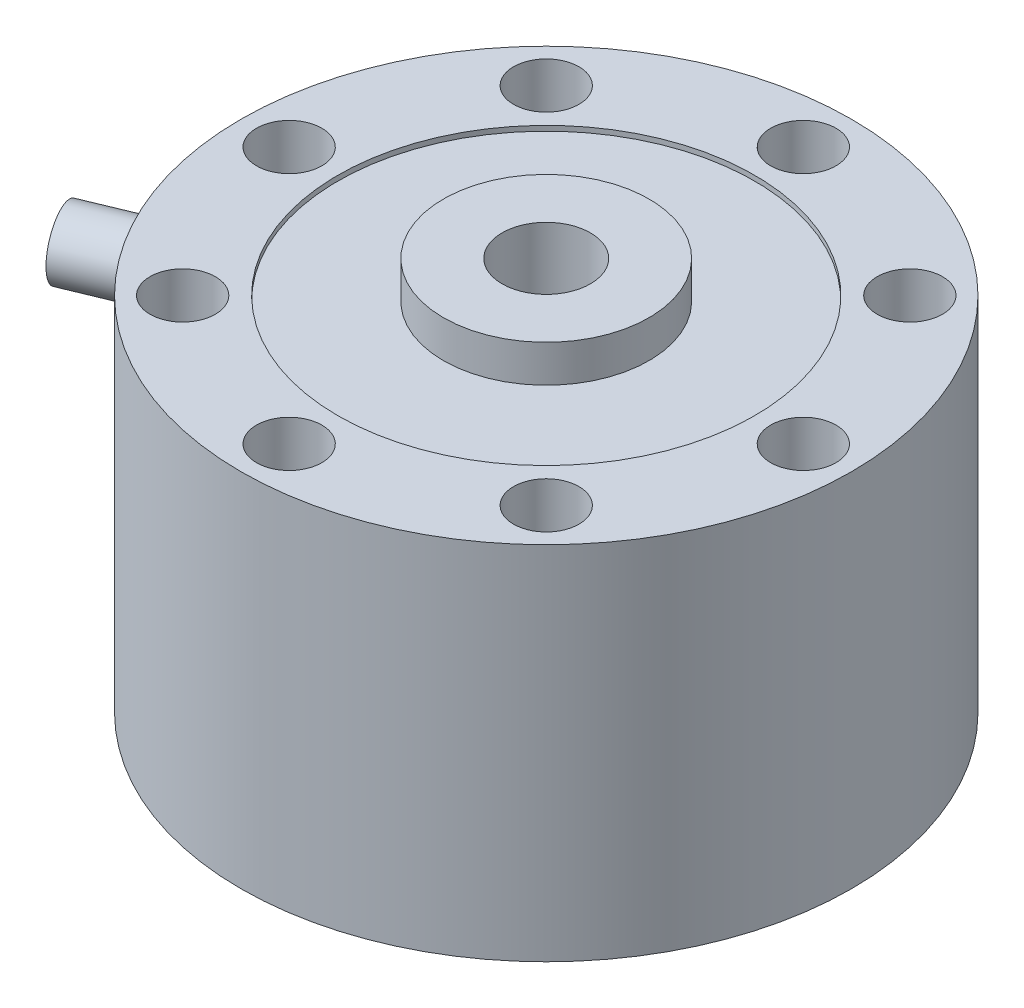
from build123d import *

# Parameters (mm, degrees)
SKETCH1_R                            = 60.325
BOSS_EXTRUDE1_DEPTH                  = 71.374
SKETCH2_R                            = 20.32
BOSS_EXTRUDE2_DEPTH                  = 6.35
BOSS_EXTRUDE3_START                  = 1.27
SKETCH3_R                            = 20.32
BOSS_EXTRUDE3_DEPTH                  = 1.27
F_3_4_16_TAPPED_HOLE1_D              = 17.4625
F_3_4_16_TAPPED_HOLE1_DEPTH          = 39.1414
F_3_4_16_TAPPED_HOLE1_TIP            = 5.24626428
F_3_4_16_TAPPED_HOLE2_D              = 17.4625
F_3_4_16_TAPPED_HOLE2_DEPTH          = 20.5994
F_3_4_16_TAPPED_HOLE2_TIP            = 5.24626428
SKETCH18_R                           = 4.3561
CUT_EXTRUDE2_DEPTH                   = 113.050711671
SKETCH19_R                           = 6.4516
CUT_EXTRUDE3_DEPTH                   = 10.16
CIRPATTERN1_COUNT                    = 8
CUT_EXTRUDE4_START                   = -1
SKETCH20_R                           = 41.170004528
SKETCH20_R_2                         = 20.32
CUT_EXTRUDE4_DEPTH                   = 1
SKETCH22_R                           = 6.35
BOSS_EXTRUDE4_DEPTH                  = 12.7
BOSS_EXTRUDE4_DIRECTION_2_REACH      = 164.689
BOSS_EXTRUDE4_DIRECTION_2_END_RADIUS = 60.325


with BuildPart() as part:
    # Sketch1 → Boss-Extrude1 (new body)
    with BuildSketch(Plane(origin=(0, 0, 0), x_dir=(1, 0, 0), z_dir=(0, 1, 0))):
        with Locations(Location((0, 0, 0), (0, 0, 270))):
            Circle(SKETCH1_R)
    extrude(amount=BOSS_EXTRUDE1_DEPTH)

    # Sketch2 → Boss-Extrude2 (add)
    with BuildSketch(Plane(origin=(0, 71.374, 0), x_dir=(1, 0, 0), z_dir=(0, 1, 0))):
        with Locations(Location((0, 0, 0), (0, 0, 270))):
            Circle(SKETCH2_R)
    extrude(amount=BOSS_EXTRUDE2_DEPTH)

    # Sketch3 → Boss-Extrude3 (add)
    with BuildSketch(Plane.XZ.offset(BOSS_EXTRUDE3_START)):
        with Locations(Location((0, 0, 0), (0, 0, 90))):
            Circle(SKETCH3_R)
    extrude(amount=-BOSS_EXTRUDE3_DEPTH)

    # 3_4-16 Tapped Hole1
    with Locations(Plane(origin=(0, 77.724, 0), x_dir=(1, 0, 0), z_dir=(0, 1, 0))):
        with Locations((0, 0)):
            Hole(F_3_4_16_TAPPED_HOLE1_D / 2, depth=F_3_4_16_TAPPED_HOLE1_DEPTH)
            with Locations((0, 0, -(F_3_4_16_TAPPED_HOLE1_DEPTH + F_3_4_16_TAPPED_HOLE1_TIP / 2))):  # 118° drill point
                Cone(0, F_3_4_16_TAPPED_HOLE1_D / 2, F_3_4_16_TAPPED_HOLE1_TIP, mode=Mode.SUBTRACT)

    # 3_4-16 Tapped Hole2
    with Locations(Plane(origin=(0, -1.27, 0), x_dir=(-1, 0, 0), z_dir=(0, -1, 0))):
        with Locations((0, 0)):
            Hole(F_3_4_16_TAPPED_HOLE2_D / 2, depth=F_3_4_16_TAPPED_HOLE2_DEPTH)
            with Locations((0, 0, -(F_3_4_16_TAPPED_HOLE2_DEPTH + F_3_4_16_TAPPED_HOLE2_TIP / 2))):  # 118° drill point
                Cone(0, F_3_4_16_TAPPED_HOLE2_D / 2, F_3_4_16_TAPPED_HOLE2_TIP, mode=Mode.SUBTRACT)

    # Sketch18 → Cut-Extrude2 (cut, through all)
    with BuildSketch(Plane(origin=(0, 71.374, 0), x_dir=(1, 0, 0), z_dir=(0, 1, 0))):
        with Locations(Location((0, 50.8, 0), (0, 0, 270))):
            Circle(SKETCH18_R)
    cut_extrude2 = extrude(amount=-CUT_EXTRUDE2_DEPTH, mode=Mode.SUBTRACT)

    # Sketch19 → Cut-Extrude3 (cut)
    with BuildSketch(Plane(origin=(0, 71.374, 0), x_dir=(1, 0, 0), z_dir=(0, 1, 0))):
        with Locations(Location((0, 50.8, 0), (0, 0, 270))):
            Circle(SKETCH19_R)
    cut_extrude3 = extrude(amount=-CUT_EXTRUDE3_DEPTH, mode=Mode.SUBTRACT)

    # CirPattern1: Cut-Extrude2, Cut-Extrude3 ×8 about axis
    cirpattern1_axis = Axis((0, 0, 0), (0, 1, 0))
    add([cut_extrude2.rotate(cirpattern1_axis, i * 360 / CIRPATTERN1_COUNT) for i in range(1, CIRPATTERN1_COUNT)], mode=Mode.SUBTRACT)
    add([cut_extrude3.rotate(cirpattern1_axis, i * 360 / CIRPATTERN1_COUNT) for i in range(1, CIRPATTERN1_COUNT)], mode=Mode.SUBTRACT)

    # Sketch20 → Cut-Extrude4 (cut)
    with BuildSketch(Plane(origin=(0, 71.374, 0), x_dir=(1, 0, 0), z_dir=(0, 1, 0)).offset(CUT_EXTRUDE4_START)):
        with Locations(Location((0, 0, 0), (0, 0, 270))):
            Circle(SKETCH20_R)
        with Locations(Location((0, 0, 0), (0, 0, 270))):
            Circle(SKETCH20_R_2, mode=Mode.SUBTRACT)
    extrude(amount=CUT_EXTRUDE4_DEPTH, mode=Mode.SUBTRACT)

    # Sketch22 → Boss-Extrude4 (add)
    with BuildSketch(Plane(origin=(-55.733032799, 0, 23.085378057), x_dir=(0.3826834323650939, 0, 0.9238795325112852), z_dir=(-0.9238795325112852, 0, 0.3826834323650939))):
        with Locations(Location((0, 60.718554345, 0), (0, 0, 180))):
            Circle(SKETCH22_R)
    extrude(amount=BOSS_EXTRUDE4_DEPTH)

    # Boss-Extrude4 direction 2: up to this cylinder (the profile starts outside it)
    boss_extrude4_direction_2_end = Plane(origin=(0, 60.718554, 0), z_dir=(0, -1, 0)) * Cylinder(BOSS_EXTRUDE4_DIRECTION_2_END_RADIUS, 451.028, mode=Mode.PRIVATE)
    # Sketch22 → Boss-Extrude4 direction 2 (add, up to the surface)
    with BuildSketch(Plane(origin=(-55.733032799, 0, 23.085378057), x_dir=(0.3826834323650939, 0, 0.9238795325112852), z_dir=(-0.9238795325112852, 0, 0.3826834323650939)), mode=Mode.PRIVATE) as boss_extrude4_direction_2_sk1:
        with Locations(Location((0, 60.718554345, 0), (0, 0, 180))):
            Circle(SKETCH22_R)
    boss_extrude4_direction_2_tool1 = extrude(boss_extrude4_direction_2_sk1.sketch, amount=-BOSS_EXTRUDE4_DIRECTION_2_REACH, mode=Mode.PRIVATE) - boss_extrude4_direction_2_end
    add(boss_extrude4_direction_2_tool1.solids().sort_by_distance((-55.733033, 60.718554, 23.085378))[0])
    add(boss_extrude4_direction_2_tool1.solids().sort_by_distance((-55.733033, 60.718554, 23.085378))[1])


solid = part.part
